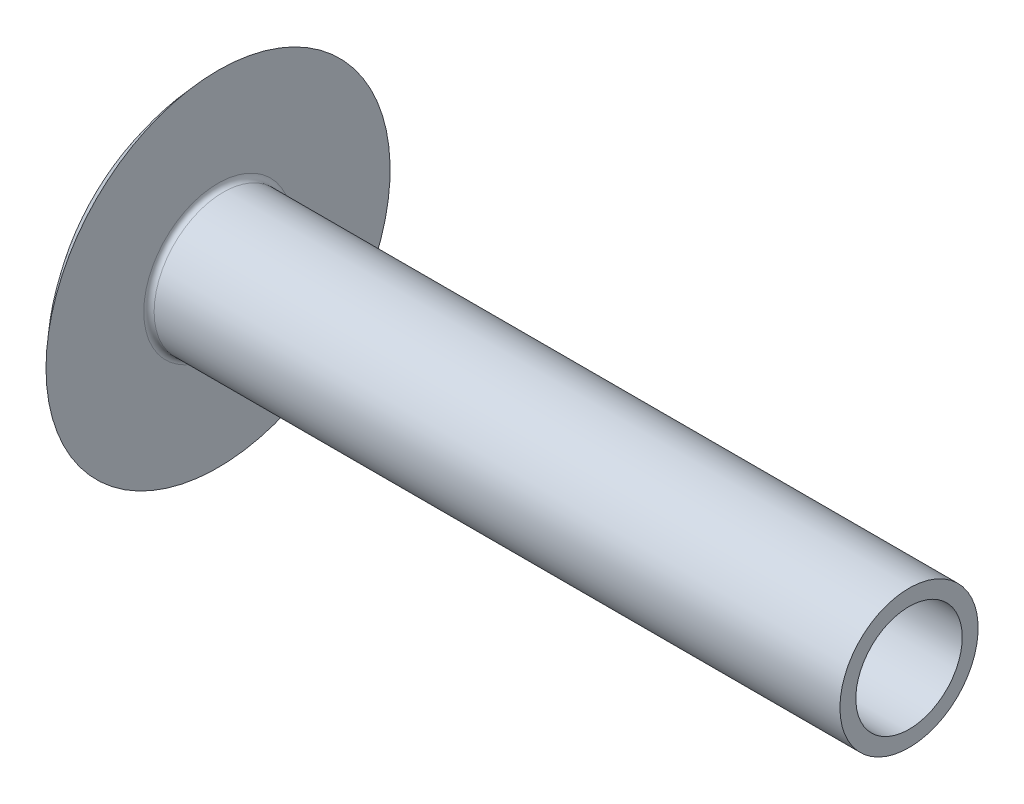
from build123d import *


with BuildPart() as part:
    # Sketch1 → Base-Revolve (revolve)
    with BuildSketch(Plane.XY, mode=Mode.PRIVATE) as base_revolve_sk:
        with BuildLine():
            Line((43.962049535, 0), (43.962049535, 4))
            Line((43.962049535, 4), (4.262049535, 4))
            ThreePointArc((4.262049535, 4), (4.049917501, 4.087867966), (3.962049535, 4.3))
            Line((3.962049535, 4.3), (3.962049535, 9.96))
            ThreePointArc((3.962049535, 9.96), (1.026873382, 5.359557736), (0, 0))
            Line((0, 0), (43.962049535, 0))
        make_face()
    revolve(base_revolve_sk.sketch.rotate(Axis((-60.094413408, 0, 0), (1, 0, 0)), 90), axis=Axis((-60.094413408, 0, 0), (1, 0, 0)))

    # Sketch2 → Cut-Revolve1 (revolve, cut)
    with BuildSketch(Plane.XY, mode=Mode.PRIVATE) as cut_revolve1_sk:
        Polygon((43.962049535, 0), (43.962049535, 3.08), (36.312049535, 3.08), (34.074298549, 0), align=None)
    revolve(cut_revolve1_sk.sketch.rotate(Axis((2.23767105, 0, 0), (-1, 0, 0)), 90), axis=Axis((2.23767105, 0, 0), (-1, 0, 0)), mode=Mode.SUBTRACT)


solid = part.part
